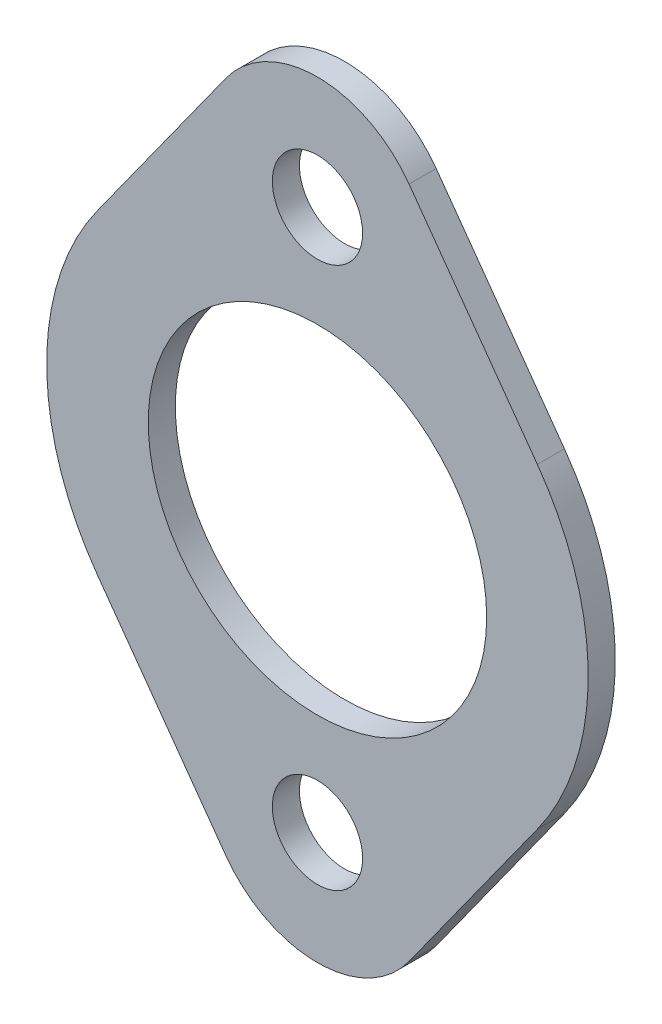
ISO-10303-21;
HEADER;
FILE_DESCRIPTION(('STEP AP214'),'2;1');
FILE_NAME('part.step','',(''),(''),'','','');
FILE_SCHEMA(('AUTOMOTIVE_DESIGN { 1 0 10303 214 1 1 1 1 }'));
ENDSEC;
DATA;
#1=APPLICATION_CONTEXT('core data for automotive mechanical design processes');
#2=APPLICATION_PROTOCOL_DEFINITION('international standard','automotive_design',2000,#1);
#3=PRODUCT_CONTEXT('',#1,'mechanical');
#4=PRODUCT('Part','Part','',(#3));
#5=PRODUCT_RELATED_PRODUCT_CATEGORY('part','',(#4));
#6=PRODUCT_DEFINITION_FORMATION('','',#4);
#7=PRODUCT_DEFINITION_CONTEXT('part definition',#1,'design');
#8=PRODUCT_DEFINITION('design','',#6,#7);
#9=PRODUCT_DEFINITION_SHAPE('','',#8);
#10=(LENGTH_UNIT() NAMED_UNIT(*) SI_UNIT(.MILLI.,.METRE.));
#11=(NAMED_UNIT(*) PLANE_ANGLE_UNIT() SI_UNIT($,.RADIAN.));
#12=(NAMED_UNIT(*) SI_UNIT($,.STERADIAN.) SOLID_ANGLE_UNIT());
#13=UNCERTAINTY_MEASURE_WITH_UNIT(LENGTH_MEASURE(1.E-05),#10,'distance_accuracy_value','');
#14=(GEOMETRIC_REPRESENTATION_CONTEXT(3) GLOBAL_UNCERTAINTY_ASSIGNED_CONTEXT((#13)) GLOBAL_UNIT_ASSIGNED_CONTEXT((#10,
#11,#12)) REPRESENTATION_CONTEXT('',''));
#15=CARTESIAN_POINT('',(0.,0.,0.));
#16=DIRECTION('',(0.,0.,1.));
#17=DIRECTION('',(1.,0.,0.));
#18=AXIS2_PLACEMENT_3D('',#15,#16,#17);
#19=CARTESIAN_POINT('',(0.,38.1,3.81));
#20=DIRECTION('',(0.,0.,-1.));
#21=DIRECTION('',(-1.,0.,0.));
#22=AXIS2_PLACEMENT_3D('',#19,#20,#21);
#23=CYLINDRICAL_SURFACE('',#22,15.875);
#24=CARTESIAN_POINT('',(0.,38.1,0.));
#25=DIRECTION('',(0.,0.,-1.));
#26=DIRECTION('',(-1.,0.,0.));
#27=AXIS2_PLACEMENT_3D('',#24,#25,#26);
#28=CIRCLE('',#27,15.875);
#29=CARTESIAN_POINT('',(-12.8941966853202,47.3604166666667,0.));
#30=VERTEX_POINT('',#29);
#31=CARTESIAN_POINT('',(12.8941966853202,47.3604166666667,0.));
#32=VERTEX_POINT('',#31);
#33=EDGE_CURVE('E95',#30,#32,#28,.T.);
#34=ORIENTED_EDGE('',*,*,#33,.F.);
#35=DIRECTION('',(0.,0.,-1.));
#36=VECTOR('',#35,1.);
#37=CARTESIAN_POINT('',(-12.8941966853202,47.3604166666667,3.81));
#38=LINE('',#37,#36);
#39=CARTESIAN_POINT('',(-12.8941966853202,47.3604166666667,3.81));
#40=VERTEX_POINT('',#39);
#41=EDGE_CURVE('E11',#40,#30,#38,.T.);
#42=ORIENTED_EDGE('',*,*,#41,.F.);
#43=CARTESIAN_POINT('',(0.,38.1,3.81));
#44=DIRECTION('',(0.,0.,-1.));
#45=DIRECTION('',(-1.,0.,0.));
#46=AXIS2_PLACEMENT_3D('',#43,#44,#45);
#47=CIRCLE('',#46,15.875);
#48=CARTESIAN_POINT('',(12.8941966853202,47.3604166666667,3.81));
#49=VERTEX_POINT('',#48);
#50=EDGE_CURVE('E96',#40,#49,#47,.T.);
#51=ORIENTED_EDGE('',*,*,#50,.T.);
#52=DIRECTION('',(0.,0.,-1.));
#53=VECTOR('',#52,1.);
#54=CARTESIAN_POINT('',(12.8941966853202,47.3604166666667,3.81));
#55=LINE('',#54,#53);
#56=EDGE_CURVE('E33',#49,#32,#55,.T.);
#57=ORIENTED_EDGE('',*,*,#56,.T.);
#58=EDGE_LOOP('',(#34,#42,#51,#57));
#59=FACE_BOUND('',#58,.T.);
#60=ADVANCED_FACE('F30',(#59),#23,.T.);
#61=CARTESIAN_POINT('',(-12.8941966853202,47.3604166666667,3.81));
#62=DIRECTION('',(0.812232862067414,-0.583333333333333,0.));
#63=DIRECTION('',(0.583333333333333,0.812232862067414,0.));
#64=AXIS2_PLACEMENT_3D('',#61,#62,#63);
#65=PLANE('',#64);
#66=DIRECTION('',(-0.583333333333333,-0.812232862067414,0.));
#67=VECTOR('',#66,1.);
#68=CARTESIAN_POINT('',(-12.8941966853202,47.3604166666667,0.));
#69=LINE('',#68,#67);
#70=CARTESIAN_POINT('',(-30.9460720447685,22.225,0.));
#71=VERTEX_POINT('',#70);
#72=EDGE_CURVE('E113',#30,#71,#69,.T.);
#73=ORIENTED_EDGE('',*,*,#72,.T.);
#74=DIRECTION('',(0.,0.,-1.));
#75=VECTOR('',#74,1.);
#76=CARTESIAN_POINT('',(-30.9460720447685,22.225,3.81));
#77=LINE('',#76,#75);
#78=CARTESIAN_POINT('',(-30.9460720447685,22.225,3.81));
#79=VERTEX_POINT('',#78);
#80=EDGE_CURVE('E38',#79,#71,#77,.T.);
#81=ORIENTED_EDGE('',*,*,#80,.F.);
#82=DIRECTION('',(-0.583333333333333,-0.812232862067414,0.));
#83=VECTOR('',#82,1.);
#84=CARTESIAN_POINT('',(-12.8941966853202,47.3604166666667,3.81));
#85=LINE('',#84,#83);
#86=EDGE_CURVE('E51',#40,#79,#85,.T.);
#87=ORIENTED_EDGE('',*,*,#86,.F.);
#88=ORIENTED_EDGE('',*,*,#41,.T.);
#89=EDGE_LOOP('',(#73,#81,#87,#88));
#90=FACE_BOUND('',#89,.T.);
#91=ADVANCED_FACE('F179',(#90),#65,.F.);
#92=CARTESIAN_POINT('',(0.,0.,3.81));
#93=DIRECTION('',(0.,0.,-1.));
#94=DIRECTION('',(-1.,0.,0.));
#95=AXIS2_PLACEMENT_3D('',#92,#93,#94);
#96=CYLINDRICAL_SURFACE('',#95,38.1);
#97=CARTESIAN_POINT('',(0.,0.,0.));
#98=DIRECTION('',(0.,0.,-1.));
#99=DIRECTION('',(-1.,0.,0.));
#100=AXIS2_PLACEMENT_3D('',#97,#98,#99);
#101=CIRCLE('',#100,38.1);
#102=CARTESIAN_POINT('',(-30.9460720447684,-22.225,0.));
#103=VERTEX_POINT('',#102);
#104=EDGE_CURVE('E130',#103,#71,#101,.T.);
#105=ORIENTED_EDGE('',*,*,#104,.F.);
#106=DIRECTION('',(0.,0.,-1.));
#107=VECTOR('',#106,1.);
#108=CARTESIAN_POINT('',(-30.9460720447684,-22.225,3.81));
#109=LINE('',#108,#107);
#110=CARTESIAN_POINT('',(-30.9460720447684,-22.225,3.81));
#111=VERTEX_POINT('',#110);
#112=EDGE_CURVE('E151',#111,#103,#109,.T.);
#113=ORIENTED_EDGE('',*,*,#112,.F.);
#114=CARTESIAN_POINT('',(0.,0.,3.81));
#115=DIRECTION('',(0.,0.,-1.));
#116=DIRECTION('',(-1.,0.,0.));
#117=AXIS2_PLACEMENT_3D('',#114,#115,#116);
#118=CIRCLE('',#117,38.1);
#119=EDGE_CURVE('E146',#111,#79,#118,.T.);
#120=ORIENTED_EDGE('',*,*,#119,.T.);
#121=ORIENTED_EDGE('',*,*,#80,.T.);
#122=EDGE_LOOP('',(#105,#113,#120,#121));
#123=FACE_BOUND('',#122,.T.);
#124=ADVANCED_FACE('F177',(#123),#96,.T.);
#125=CARTESIAN_POINT('',(-12.8941966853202,-47.3604166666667,3.81));
#126=DIRECTION('',(-0.812232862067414,-0.583333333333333,0.));
#127=DIRECTION('',(0.583333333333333,-0.812232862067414,0.));
#128=AXIS2_PLACEMENT_3D('',#125,#126,#127);
#129=PLANE('',#128);
#130=DIRECTION('',(-0.583333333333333,0.812232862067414,0.));
#131=VECTOR('',#130,1.);
#132=CARTESIAN_POINT('',(-12.8941966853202,-47.3604166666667,0.));
#133=LINE('',#132,#131);
#134=CARTESIAN_POINT('',(-12.8941966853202,-47.3604166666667,0.));
#135=VERTEX_POINT('',#134);
#136=EDGE_CURVE('E127',#135,#103,#133,.T.);
#137=ORIENTED_EDGE('',*,*,#136,.F.);
#138=DIRECTION('',(0.,0.,-1.));
#139=VECTOR('',#138,1.);
#140=CARTESIAN_POINT('',(-12.8941966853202,-47.3604166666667,3.81));
#141=LINE('',#140,#139);
#142=CARTESIAN_POINT('',(-12.8941966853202,-47.3604166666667,3.81));
#143=VERTEX_POINT('',#142);
#144=EDGE_CURVE('E153',#143,#135,#141,.T.);
#145=ORIENTED_EDGE('',*,*,#144,.F.);
#146=DIRECTION('',(-0.583333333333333,0.812232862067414,0.));
#147=VECTOR('',#146,1.);
#148=CARTESIAN_POINT('',(-12.8941966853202,-47.3604166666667,3.81));
#149=LINE('',#148,#147);
#150=EDGE_CURVE('E143',#143,#111,#149,.T.);
#151=ORIENTED_EDGE('',*,*,#150,.T.);
#152=ORIENTED_EDGE('',*,*,#112,.T.);
#153=EDGE_LOOP('',(#137,#145,#151,#152));
#154=FACE_BOUND('',#153,.T.);
#155=ADVANCED_FACE('F172',(#154),#129,.T.);
#156=CARTESIAN_POINT('',(0.,-38.1,3.81));
#157=DIRECTION('',(0.,0.,-1.));
#158=DIRECTION('',(-1.,0.,0.));
#159=AXIS2_PLACEMENT_3D('',#156,#157,#158);
#160=CYLINDRICAL_SURFACE('',#159,15.875);
#161=CARTESIAN_POINT('',(0.,-38.1,0.));
#162=DIRECTION('',(0.,0.,1.));
#163=DIRECTION('',(1.,0.,0.));
#164=AXIS2_PLACEMENT_3D('',#161,#162,#163);
#165=CIRCLE('',#164,15.875);
#166=CARTESIAN_POINT('',(12.8941966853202,-47.3604166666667,0.));
#167=VERTEX_POINT('',#166);
#168=EDGE_CURVE('E125',#135,#167,#165,.T.);
#169=ORIENTED_EDGE('',*,*,#168,.T.);
#170=DIRECTION('',(0.,0.,-1.));
#171=VECTOR('',#170,1.);
#172=CARTESIAN_POINT('',(12.8941966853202,-47.3604166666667,3.81));
#173=LINE('',#172,#171);
#174=CARTESIAN_POINT('',(12.8941966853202,-47.3604166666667,3.81));
#175=VERTEX_POINT('',#174);
#176=EDGE_CURVE('E155',#175,#167,#173,.T.);
#177=ORIENTED_EDGE('',*,*,#176,.F.);
#178=CARTESIAN_POINT('',(0.,-38.1,3.81));
#179=DIRECTION('',(0.,0.,1.));
#180=DIRECTION('',(1.,0.,0.));
#181=AXIS2_PLACEMENT_3D('',#178,#179,#180);
#182=CIRCLE('',#181,15.875);
#183=EDGE_CURVE('E141',#143,#175,#182,.T.);
#184=ORIENTED_EDGE('',*,*,#183,.F.);
#185=ORIENTED_EDGE('',*,*,#144,.T.);
#186=EDGE_LOOP('',(#169,#177,#184,#185));
#187=FACE_BOUND('',#186,.T.);
#188=ADVANCED_FACE('F181',(#187),#160,.T.);
#189=CARTESIAN_POINT('',(12.8941966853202,-47.3604166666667,3.81));
#190=DIRECTION('',(-0.812232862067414,0.583333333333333,0.));
#191=DIRECTION('',(-0.583333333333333,-0.812232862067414,0.));
#192=AXIS2_PLACEMENT_3D('',#189,#190,#191);
#193=PLANE('',#192);
#194=DIRECTION('',(0.583333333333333,0.812232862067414,0.));
#195=VECTOR('',#194,1.);
#196=CARTESIAN_POINT('',(12.8941966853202,-47.3604166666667,0.));
#197=LINE('',#196,#195);
#198=CARTESIAN_POINT('',(30.9460720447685,-22.225,0.));
#199=VERTEX_POINT('',#198);
#200=EDGE_CURVE('E122',#167,#199,#197,.T.);
#201=ORIENTED_EDGE('',*,*,#200,.T.);
#202=DIRECTION('',(0.,0.,-1.));
#203=VECTOR('',#202,1.);
#204=CARTESIAN_POINT('',(30.9460720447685,-22.225,3.81));
#205=LINE('',#204,#203);
#206=CARTESIAN_POINT('',(30.9460720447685,-22.225,3.81));
#207=VERTEX_POINT('',#206);
#208=EDGE_CURVE('E158',#207,#199,#205,.T.);
#209=ORIENTED_EDGE('',*,*,#208,.F.);
#210=DIRECTION('',(0.583333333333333,0.812232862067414,0.));
#211=VECTOR('',#210,1.);
#212=CARTESIAN_POINT('',(12.8941966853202,-47.3604166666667,3.81));
#213=LINE('',#212,#211);
#214=EDGE_CURVE('E139',#175,#207,#213,.T.);
#215=ORIENTED_EDGE('',*,*,#214,.F.);
#216=ORIENTED_EDGE('',*,*,#176,.T.);
#217=EDGE_LOOP('',(#201,#209,#215,#216));
#218=FACE_BOUND('',#217,.T.);
#219=ADVANCED_FACE('F166',(#218),#193,.F.);
#220=CARTESIAN_POINT('',(0.,0.,3.81));
#221=DIRECTION('',(0.,0.,-1.));
#222=DIRECTION('',(-1.,0.,0.));
#223=AXIS2_PLACEMENT_3D('',#220,#221,#222);
#224=CYLINDRICAL_SURFACE('',#223,38.1);
#225=CARTESIAN_POINT('',(0.,0.,0.));
#226=DIRECTION('',(0.,0.,-1.));
#227=DIRECTION('',(-1.,0.,0.));
#228=AXIS2_PLACEMENT_3D('',#225,#226,#227);
#229=CIRCLE('',#228,38.1);
#230=CARTESIAN_POINT('',(30.9460720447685,22.225,0.));
#231=VERTEX_POINT('',#230);
#232=EDGE_CURVE('E107',#231,#199,#229,.T.);
#233=ORIENTED_EDGE('',*,*,#232,.F.);
#234=DIRECTION('',(0.,0.,-1.));
#235=VECTOR('',#234,1.);
#236=CARTESIAN_POINT('',(30.9460720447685,22.225,3.81));
#237=LINE('',#236,#235);
#238=CARTESIAN_POINT('',(30.9460720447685,22.225,3.81));
#239=VERTEX_POINT('',#238);
#240=EDGE_CURVE('E100',#239,#231,#237,.T.);
#241=ORIENTED_EDGE('',*,*,#240,.F.);
#242=CARTESIAN_POINT('',(0.,0.,3.81));
#243=DIRECTION('',(0.,0.,-1.));
#244=DIRECTION('',(-1.,0.,0.));
#245=AXIS2_PLACEMENT_3D('',#242,#243,#244);
#246=CIRCLE('',#245,38.1);
#247=EDGE_CURVE('E136',#239,#207,#246,.T.);
#248=ORIENTED_EDGE('',*,*,#247,.T.);
#249=ORIENTED_EDGE('',*,*,#208,.T.);
#250=EDGE_LOOP('',(#233,#241,#248,#249));
#251=FACE_BOUND('',#250,.T.);
#252=ADVANCED_FACE('F161',(#251),#224,.T.);
#253=CARTESIAN_POINT('',(12.8941966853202,47.3604166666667,3.81));
#254=DIRECTION('',(0.812232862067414,0.583333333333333,0.));
#255=DIRECTION('',(-0.583333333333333,0.812232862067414,0.));
#256=AXIS2_PLACEMENT_3D('',#253,#254,#255);
#257=PLANE('',#256);
#258=DIRECTION('',(0.583333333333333,-0.812232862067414,0.));
#259=VECTOR('',#258,1.);
#260=CARTESIAN_POINT('',(12.8941966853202,47.3604166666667,0.));
#261=LINE('',#260,#259);
#262=EDGE_CURVE('E102',#32,#231,#261,.T.);
#263=ORIENTED_EDGE('',*,*,#262,.F.);
#264=ORIENTED_EDGE('',*,*,#56,.F.);
#265=DIRECTION('',(0.583333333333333,-0.812232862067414,0.));
#266=VECTOR('',#265,1.);
#267=CARTESIAN_POINT('',(12.8941966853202,47.3604166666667,3.81));
#268=LINE('',#267,#266);
#269=EDGE_CURVE('E134',#49,#239,#268,.T.);
#270=ORIENTED_EDGE('',*,*,#269,.T.);
#271=ORIENTED_EDGE('',*,*,#240,.T.);
#272=EDGE_LOOP('',(#263,#264,#270,#271));
#273=FACE_BOUND('',#272,.T.);
#274=ADVANCED_FACE('F103',(#273),#257,.T.);
#275=CARTESIAN_POINT('',(0.,38.1,3.81));
#276=DIRECTION('',(0.,0.,-1.));
#277=DIRECTION('',(-1.,0.,0.));
#278=AXIS2_PLACEMENT_3D('',#275,#276,#277);
#279=PLANE('',#278);
#280=CARTESIAN_POINT('',(0.,0.,3.81));
#281=DIRECTION('',(0.,0.,1.));
#282=DIRECTION('',(1.,0.,0.));
#283=AXIS2_PLACEMENT_3D('',#280,#281,#282);
#284=CIRCLE('',#283,23.8125);
#285=CARTESIAN_POINT('',(23.8125,0.,3.81));
#286=VERTEX_POINT('',#285);
#287=EDGE_CURVE('E225',#286,#286,#284,.T.);
#288=ORIENTED_EDGE('',*,*,#287,.F.);
#289=EDGE_LOOP('',(#288));
#290=FACE_BOUND('',#289,.T.);
#291=CARTESIAN_POINT('',(0.,-38.1,3.81));
#292=DIRECTION('',(0.,0.,1.));
#293=DIRECTION('',(1.,0.,0.));
#294=AXIS2_PLACEMENT_3D('',#291,#292,#293);
#295=CIRCLE('',#294,6.35);
#296=CARTESIAN_POINT('',(6.35,-38.1,3.81));
#297=VERTEX_POINT('',#296);
#298=EDGE_CURVE('E227',#297,#297,#295,.T.);
#299=ORIENTED_EDGE('',*,*,#298,.F.);
#300=EDGE_LOOP('',(#299));
#301=FACE_BOUND('',#300,.T.);
#302=CARTESIAN_POINT('',(0.,38.1,3.81));
#303=DIRECTION('',(0.,0.,1.));
#304=DIRECTION('',(1.,0.,0.));
#305=AXIS2_PLACEMENT_3D('',#302,#303,#304);
#306=CIRCLE('',#305,6.35);
#307=CARTESIAN_POINT('',(6.35,38.1,3.81));
#308=VERTEX_POINT('',#307);
#309=EDGE_CURVE('E117',#308,#308,#306,.T.);
#310=ORIENTED_EDGE('',*,*,#309,.F.);
#311=EDGE_LOOP('',(#310));
#312=FACE_BOUND('',#311,.T.);
#313=ORIENTED_EDGE('',*,*,#50,.F.);
#314=ORIENTED_EDGE('',*,*,#86,.T.);
#315=ORIENTED_EDGE('',*,*,#119,.F.);
#316=ORIENTED_EDGE('',*,*,#150,.F.);
#317=ORIENTED_EDGE('',*,*,#183,.T.);
#318=ORIENTED_EDGE('',*,*,#214,.T.);
#319=ORIENTED_EDGE('',*,*,#247,.F.);
#320=ORIENTED_EDGE('',*,*,#269,.F.);
#321=EDGE_LOOP('',(#313,#314,#315,#316,#317,#318,#319,#320));
#322=FACE_BOUND('',#321,.T.);
#323=ADVANCED_FACE('F180',(#290,#301,#312,#322),#279,.F.);
#324=CARTESIAN_POINT('',(0.,38.1,0.));
#325=DIRECTION('',(0.,0.,-1.));
#326=DIRECTION('',(-1.,0.,0.));
#327=AXIS2_PLACEMENT_3D('',#324,#325,#326);
#328=PLANE('',#327);
#329=CARTESIAN_POINT('',(0.,0.,0.));
#330=DIRECTION('',(0.,0.,1.));
#331=DIRECTION('',(1.,0.,0.));
#332=AXIS2_PLACEMENT_3D('',#329,#330,#331);
#333=CIRCLE('',#332,23.8125);
#334=CARTESIAN_POINT('',(23.8125,0.,0.));
#335=VERTEX_POINT('',#334);
#336=EDGE_CURVE('E222',#335,#335,#333,.T.);
#337=ORIENTED_EDGE('',*,*,#336,.T.);
#338=EDGE_LOOP('',(#337));
#339=FACE_BOUND('',#338,.T.);
#340=CARTESIAN_POINT('',(0.,-38.1,0.));
#341=DIRECTION('',(0.,0.,1.));
#342=DIRECTION('',(1.,0.,0.));
#343=AXIS2_PLACEMENT_3D('',#340,#341,#342);
#344=CIRCLE('',#343,6.35);
#345=CARTESIAN_POINT('',(6.35,-38.1,0.));
#346=VERTEX_POINT('',#345);
#347=EDGE_CURVE('E232',#346,#346,#344,.T.);
#348=ORIENTED_EDGE('',*,*,#347,.T.);
#349=EDGE_LOOP('',(#348));
#350=FACE_BOUND('',#349,.T.);
#351=CARTESIAN_POINT('',(0.,38.1,0.));
#352=DIRECTION('',(0.,0.,1.));
#353=DIRECTION('',(1.,0.,0.));
#354=AXIS2_PLACEMENT_3D('',#351,#352,#353);
#355=CIRCLE('',#354,6.35);
#356=CARTESIAN_POINT('',(6.35,38.1,0.));
#357=VERTEX_POINT('',#356);
#358=EDGE_CURVE('E114',#357,#357,#355,.T.);
#359=ORIENTED_EDGE('',*,*,#358,.T.);
#360=EDGE_LOOP('',(#359));
#361=FACE_BOUND('',#360,.T.);
#362=ORIENTED_EDGE('',*,*,#33,.T.);
#363=ORIENTED_EDGE('',*,*,#262,.T.);
#364=ORIENTED_EDGE('',*,*,#232,.T.);
#365=ORIENTED_EDGE('',*,*,#200,.F.);
#366=ORIENTED_EDGE('',*,*,#168,.F.);
#367=ORIENTED_EDGE('',*,*,#136,.T.);
#368=ORIENTED_EDGE('',*,*,#104,.T.);
#369=ORIENTED_EDGE('',*,*,#72,.F.);
#370=EDGE_LOOP('',(#362,#363,#364,#365,#366,#367,#368,#369));
#371=FACE_BOUND('',#370,.T.);
#372=ADVANCED_FACE('F110',(#339,#350,#361,#371),#328,.T.);
#373=CARTESIAN_POINT('',(0.,38.1,0.));
#374=DIRECTION('',(0.,0.,1.));
#375=DIRECTION('',(1.,0.,0.));
#376=AXIS2_PLACEMENT_3D('',#373,#374,#375);
#377=CYLINDRICAL_SURFACE('',#376,6.35);
#378=CARTESIAN_POINT('',(6.35,38.1,0.));
#379=CARTESIAN_POINT('',(6.35,38.1,0.0396874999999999));
#380=CARTESIAN_POINT('',(6.35,38.1,0.079375));
#381=CARTESIAN_POINT('',(6.35,38.1,0.15875));
#382=CARTESIAN_POINT('',(6.35,38.1,0.1984375));
#383=CARTESIAN_POINT('',(6.35,38.1,0.2778125));
#384=CARTESIAN_POINT('',(6.35,38.1,0.3175));
#385=CARTESIAN_POINT('',(6.35,38.1,0.396875));
#386=CARTESIAN_POINT('',(6.35,38.1,0.4365625));
#387=CARTESIAN_POINT('',(6.35,38.1,0.5159375));
#388=CARTESIAN_POINT('',(6.35,38.1,0.555625));
#389=CARTESIAN_POINT('',(6.35,38.1,0.635));
#390=CARTESIAN_POINT('',(6.35,38.1,0.6746875));
#391=CARTESIAN_POINT('',(6.35,38.1,0.7540625));
#392=CARTESIAN_POINT('',(6.35,38.1,0.79375));
#393=CARTESIAN_POINT('',(6.35,38.1,0.873125));
#394=CARTESIAN_POINT('',(6.35,38.1,0.9128125));
#395=CARTESIAN_POINT('',(6.35,38.1,0.9921875));
#396=CARTESIAN_POINT('',(6.35,38.1,1.031875));
#397=CARTESIAN_POINT('',(6.35,38.1,1.11125));
#398=CARTESIAN_POINT('',(6.35,38.1,1.1509375));
#399=CARTESIAN_POINT('',(6.35,38.1,1.2303125));
#400=CARTESIAN_POINT('',(6.35,38.1,1.27));
#401=CARTESIAN_POINT('',(6.35,38.1,1.349375));
#402=CARTESIAN_POINT('',(6.35,38.1,1.3890625));
#403=CARTESIAN_POINT('',(6.35,38.1,1.4684375));
#404=CARTESIAN_POINT('',(6.35,38.1,1.508125));
#405=CARTESIAN_POINT('',(6.35,38.1,1.5875));
#406=CARTESIAN_POINT('',(6.35,38.1,1.6271875));
#407=CARTESIAN_POINT('',(6.35,38.1,1.7065625));
#408=CARTESIAN_POINT('',(6.35,38.1,1.74625));
#409=CARTESIAN_POINT('',(6.35,38.1,1.825625));
#410=CARTESIAN_POINT('',(6.35,38.1,1.8653125));
#411=CARTESIAN_POINT('',(6.35,38.1,1.9446875));
#412=CARTESIAN_POINT('',(6.35,38.1,1.984375));
#413=CARTESIAN_POINT('',(6.35,38.1,2.06375));
#414=CARTESIAN_POINT('',(6.35,38.1,2.1034375));
#415=CARTESIAN_POINT('',(6.35,38.1,2.1828125));
#416=CARTESIAN_POINT('',(6.35,38.1,2.2225));
#417=CARTESIAN_POINT('',(6.35,38.1,2.301875));
#418=CARTESIAN_POINT('',(6.35,38.1,2.3415625));
#419=CARTESIAN_POINT('',(6.35,38.1,2.4209375));
#420=CARTESIAN_POINT('',(6.35,38.1,2.460625));
#421=CARTESIAN_POINT('',(6.35,38.1,2.54));
#422=CARTESIAN_POINT('',(6.35,38.1,2.5796875));
#423=CARTESIAN_POINT('',(6.35,38.1,2.6590625));
#424=CARTESIAN_POINT('',(6.35,38.1,2.69875));
#425=CARTESIAN_POINT('',(6.35,38.1,2.778125));
#426=CARTESIAN_POINT('',(6.35,38.1,2.8178125));
#427=CARTESIAN_POINT('',(6.35,38.1,2.8971875));
#428=CARTESIAN_POINT('',(6.35,38.1,2.936875));
#429=CARTESIAN_POINT('',(6.35,38.1,3.01625));
#430=CARTESIAN_POINT('',(6.35,38.1,3.0559375));
#431=CARTESIAN_POINT('',(6.35,38.1,3.1353125));
#432=CARTESIAN_POINT('',(6.35,38.1,3.175));
#433=CARTESIAN_POINT('',(6.35,38.1,3.254375));
#434=CARTESIAN_POINT('',(6.35,38.1,3.2940625));
#435=CARTESIAN_POINT('',(6.35,38.1,3.3734375));
#436=CARTESIAN_POINT('',(6.35,38.1,3.413125));
#437=CARTESIAN_POINT('',(6.35,38.1,3.4925));
#438=CARTESIAN_POINT('',(6.35,38.1,3.5321875));
#439=CARTESIAN_POINT('',(6.35,38.1,3.6115625));
#440=CARTESIAN_POINT('',(6.35,38.1,3.65125));
#441=CARTESIAN_POINT('',(6.35,38.1,3.730625));
#442=CARTESIAN_POINT('',(6.35,38.1,3.7703125));
#443=CARTESIAN_POINT('',(6.35,38.1,3.81));
#444=B_SPLINE_CURVE_WITH_KNOTS('',3,(#378,#379,#380,#381,#382,#383,#384,#385,#386,#387,#388,
#389,#390,#391,#392,#393,#394,#395,#396,#397,#398,#399,#400,#401,#402,#403,#404,#405,#406,#407,
#408,#409,#410,#411,#412,#413,#414,#415,#416,#417,#418,#419,#420,#421,#422,#423,#424,#425,#426,
#427,#428,#429,#430,#431,#432,#433,#434,#435,#436,#437,#438,#439,#440,#441,#442,#443),
.UNSPECIFIED.,.F.,.F.,(4,2,2,2,2,2,2,2,2,2,2,2,2,2,2,2,2,2,2,2,2,2,2,2,2,2,2,2,2,2,2,2,4),(0.,
0.1190625,0.238125,0.3571875,0.47625,0.5953125,0.714375,0.8334375,0.9525,1.0715625,1.190625,
1.3096875,1.42875,1.5478125,1.666875,1.7859375,1.905,2.0240625,2.143125,2.2621875,2.38125,
2.5003125,2.619375,2.7384375,2.8575,2.9765625,3.095625,3.2146875,3.33375,3.4528125,3.571875,
3.6909375,3.81),.UNSPECIFIED.);
#445=EDGE_CURVE('BSEAM205',#357,#308,#444,.T.);
#446=ORIENTED_EDGE('',*,*,#358,.F.);
#447=ORIENTED_EDGE('',*,*,#309,.T.);
#448=ORIENTED_EDGE('',*,*,#445,.T.);
#449=ORIENTED_EDGE('',*,*,#445,.F.);
#450=EDGE_LOOP('',(#446,#448,#447,#449));
#451=FACE_BOUND('',#450,.T.);
#452=ADVANCED_FACE('F205',(#451),#377,.F.);
#453=CARTESIAN_POINT('',(0.,-38.1,0.));
#454=DIRECTION('',(0.,0.,1.));
#455=DIRECTION('',(1.,0.,0.));
#456=AXIS2_PLACEMENT_3D('',#453,#454,#455);
#457=CYLINDRICAL_SURFACE('',#456,6.35);
#458=CARTESIAN_POINT('',(6.35,-38.1,0.));
#459=CARTESIAN_POINT('',(6.35,-38.1,0.0396874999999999));
#460=CARTESIAN_POINT('',(6.35,-38.1,0.079375));
#461=CARTESIAN_POINT('',(6.35,-38.1,0.15875));
#462=CARTESIAN_POINT('',(6.35,-38.1,0.1984375));
#463=CARTESIAN_POINT('',(6.35,-38.1,0.2778125));
#464=CARTESIAN_POINT('',(6.35,-38.1,0.3175));
#465=CARTESIAN_POINT('',(6.35,-38.1,0.396875));
#466=CARTESIAN_POINT('',(6.35,-38.1,0.4365625));
#467=CARTESIAN_POINT('',(6.35,-38.1,0.5159375));
#468=CARTESIAN_POINT('',(6.35,-38.1,0.555625));
#469=CARTESIAN_POINT('',(6.35,-38.1,0.635));
#470=CARTESIAN_POINT('',(6.35,-38.1,0.6746875));
#471=CARTESIAN_POINT('',(6.35,-38.1,0.7540625));
#472=CARTESIAN_POINT('',(6.35,-38.1,0.79375));
#473=CARTESIAN_POINT('',(6.35,-38.1,0.873125));
#474=CARTESIAN_POINT('',(6.35,-38.1,0.9128125));
#475=CARTESIAN_POINT('',(6.35,-38.1,0.9921875));
#476=CARTESIAN_POINT('',(6.35,-38.1,1.031875));
#477=CARTESIAN_POINT('',(6.35,-38.1,1.11125));
#478=CARTESIAN_POINT('',(6.35,-38.1,1.1509375));
#479=CARTESIAN_POINT('',(6.35,-38.1,1.2303125));
#480=CARTESIAN_POINT('',(6.35,-38.1,1.27));
#481=CARTESIAN_POINT('',(6.35,-38.1,1.349375));
#482=CARTESIAN_POINT('',(6.35,-38.1,1.3890625));
#483=CARTESIAN_POINT('',(6.35,-38.1,1.4684375));
#484=CARTESIAN_POINT('',(6.35,-38.1,1.508125));
#485=CARTESIAN_POINT('',(6.35,-38.1,1.5875));
#486=CARTESIAN_POINT('',(6.35,-38.1,1.6271875));
#487=CARTESIAN_POINT('',(6.35,-38.1,1.7065625));
#488=CARTESIAN_POINT('',(6.35,-38.1,1.74625));
#489=CARTESIAN_POINT('',(6.35,-38.1,1.825625));
#490=CARTESIAN_POINT('',(6.35,-38.1,1.8653125));
#491=CARTESIAN_POINT('',(6.35,-38.1,1.9446875));
#492=CARTESIAN_POINT('',(6.35,-38.1,1.984375));
#493=CARTESIAN_POINT('',(6.35,-38.1,2.06375));
#494=CARTESIAN_POINT('',(6.35,-38.1,2.1034375));
#495=CARTESIAN_POINT('',(6.35,-38.1,2.1828125));
#496=CARTESIAN_POINT('',(6.35,-38.1,2.2225));
#497=CARTESIAN_POINT('',(6.35,-38.1,2.301875));
#498=CARTESIAN_POINT('',(6.35,-38.1,2.3415625));
#499=CARTESIAN_POINT('',(6.35,-38.1,2.4209375));
#500=CARTESIAN_POINT('',(6.35,-38.1,2.460625));
#501=CARTESIAN_POINT('',(6.35,-38.1,2.54));
#502=CARTESIAN_POINT('',(6.35,-38.1,2.5796875));
#503=CARTESIAN_POINT('',(6.35,-38.1,2.6590625));
#504=CARTESIAN_POINT('',(6.35,-38.1,2.69875));
#505=CARTESIAN_POINT('',(6.35,-38.1,2.778125));
#506=CARTESIAN_POINT('',(6.35,-38.1,2.8178125));
#507=CARTESIAN_POINT('',(6.35,-38.1,2.8971875));
#508=CARTESIAN_POINT('',(6.35,-38.1,2.936875));
#509=CARTESIAN_POINT('',(6.35,-38.1,3.01625));
#510=CARTESIAN_POINT('',(6.35,-38.1,3.0559375));
#511=CARTESIAN_POINT('',(6.35,-38.1,3.1353125));
#512=CARTESIAN_POINT('',(6.35,-38.1,3.175));
#513=CARTESIAN_POINT('',(6.35,-38.1,3.254375));
#514=CARTESIAN_POINT('',(6.35,-38.1,3.2940625));
#515=CARTESIAN_POINT('',(6.35,-38.1,3.3734375));
#516=CARTESIAN_POINT('',(6.35,-38.1,3.413125));
#517=CARTESIAN_POINT('',(6.35,-38.1,3.4925));
#518=CARTESIAN_POINT('',(6.35,-38.1,3.5321875));
#519=CARTESIAN_POINT('',(6.35,-38.1,3.6115625));
#520=CARTESIAN_POINT('',(6.35,-38.1,3.65125));
#521=CARTESIAN_POINT('',(6.35,-38.1,3.730625));
#522=CARTESIAN_POINT('',(6.35,-38.1,3.7703125));
#523=CARTESIAN_POINT('',(6.35,-38.1,3.81));
#524=B_SPLINE_CURVE_WITH_KNOTS('',3,(#458,#459,#460,#461,#462,#463,#464,#465,#466,#467,#468,
#469,#470,#471,#472,#473,#474,#475,#476,#477,#478,#479,#480,#481,#482,#483,#484,#485,#486,#487,
#488,#489,#490,#491,#492,#493,#494,#495,#496,#497,#498,#499,#500,#501,#502,#503,#504,#505,#506,
#507,#508,#509,#510,#511,#512,#513,#514,#515,#516,#517,#518,#519,#520,#521,#522,#523),
.UNSPECIFIED.,.F.,.F.,(4,2,2,2,2,2,2,2,2,2,2,2,2,2,2,2,2,2,2,2,2,2,2,2,2,2,2,2,2,2,2,2,4),(0.,
0.1190625,0.238125,0.3571875,0.47625,0.5953125,0.714375,0.8334375,0.9525,1.0715625,1.190625,
1.3096875,1.42875,1.5478125,1.666875,1.7859375,1.905,2.0240625,2.143125,2.2621875,2.38125,
2.5003125,2.619375,2.7384375,2.8575,2.9765625,3.095625,3.2146875,3.33375,3.4528125,3.571875,
3.6909375,3.81),.UNSPECIFIED.);
#525=EDGE_CURVE('BSEAM209',#346,#297,#524,.T.);
#526=ORIENTED_EDGE('',*,*,#347,.F.);
#527=ORIENTED_EDGE('',*,*,#298,.T.);
#528=ORIENTED_EDGE('',*,*,#525,.T.);
#529=ORIENTED_EDGE('',*,*,#525,.F.);
#530=EDGE_LOOP('',(#526,#528,#527,#529));
#531=FACE_BOUND('',#530,.T.);
#532=ADVANCED_FACE('F209',(#531),#457,.F.);
#533=CARTESIAN_POINT('',(0.,0.,0.));
#534=DIRECTION('',(0.,0.,1.));
#535=DIRECTION('',(1.,0.,0.));
#536=AXIS2_PLACEMENT_3D('',#533,#534,#535);
#537=CYLINDRICAL_SURFACE('',#536,23.8125);
#538=CARTESIAN_POINT('',(23.8125,0.,0.));
#539=CARTESIAN_POINT('',(23.8125,0.,0.0396874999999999));
#540=CARTESIAN_POINT('',(23.8125,0.,0.079375));
#541=CARTESIAN_POINT('',(23.8125,0.,0.15875));
#542=CARTESIAN_POINT('',(23.8125,0.,0.1984375));
#543=CARTESIAN_POINT('',(23.8125,0.,0.2778125));
#544=CARTESIAN_POINT('',(23.8125,0.,0.3175));
#545=CARTESIAN_POINT('',(23.8125,0.,0.396875));
#546=CARTESIAN_POINT('',(23.8125,0.,0.4365625));
#547=CARTESIAN_POINT('',(23.8125,0.,0.5159375));
#548=CARTESIAN_POINT('',(23.8125,0.,0.555625));
#549=CARTESIAN_POINT('',(23.8125,0.,0.635));
#550=CARTESIAN_POINT('',(23.8125,0.,0.6746875));
#551=CARTESIAN_POINT('',(23.8125,0.,0.7540625));
#552=CARTESIAN_POINT('',(23.8125,0.,0.79375));
#553=CARTESIAN_POINT('',(23.8125,0.,0.873125));
#554=CARTESIAN_POINT('',(23.8125,0.,0.9128125));
#555=CARTESIAN_POINT('',(23.8125,0.,0.9921875));
#556=CARTESIAN_POINT('',(23.8125,0.,1.031875));
#557=CARTESIAN_POINT('',(23.8125,0.,1.11125));
#558=CARTESIAN_POINT('',(23.8125,0.,1.1509375));
#559=CARTESIAN_POINT('',(23.8125,0.,1.2303125));
#560=CARTESIAN_POINT('',(23.8125,0.,1.27));
#561=CARTESIAN_POINT('',(23.8125,0.,1.349375));
#562=CARTESIAN_POINT('',(23.8125,0.,1.3890625));
#563=CARTESIAN_POINT('',(23.8125,0.,1.4684375));
#564=CARTESIAN_POINT('',(23.8125,0.,1.508125));
#565=CARTESIAN_POINT('',(23.8125,0.,1.5875));
#566=CARTESIAN_POINT('',(23.8125,0.,1.6271875));
#567=CARTESIAN_POINT('',(23.8125,0.,1.7065625));
#568=CARTESIAN_POINT('',(23.8125,0.,1.74625));
#569=CARTESIAN_POINT('',(23.8125,0.,1.825625));
#570=CARTESIAN_POINT('',(23.8125,0.,1.8653125));
#571=CARTESIAN_POINT('',(23.8125,0.,1.9446875));
#572=CARTESIAN_POINT('',(23.8125,0.,1.984375));
#573=CARTESIAN_POINT('',(23.8125,0.,2.06375));
#574=CARTESIAN_POINT('',(23.8125,0.,2.1034375));
#575=CARTESIAN_POINT('',(23.8125,0.,2.1828125));
#576=CARTESIAN_POINT('',(23.8125,0.,2.2225));
#577=CARTESIAN_POINT('',(23.8125,0.,2.301875));
#578=CARTESIAN_POINT('',(23.8125,0.,2.3415625));
#579=CARTESIAN_POINT('',(23.8125,0.,2.4209375));
#580=CARTESIAN_POINT('',(23.8125,0.,2.460625));
#581=CARTESIAN_POINT('',(23.8125,0.,2.54));
#582=CARTESIAN_POINT('',(23.8125,0.,2.5796875));
#583=CARTESIAN_POINT('',(23.8125,0.,2.6590625));
#584=CARTESIAN_POINT('',(23.8125,0.,2.69875));
#585=CARTESIAN_POINT('',(23.8125,0.,2.778125));
#586=CARTESIAN_POINT('',(23.8125,0.,2.8178125));
#587=CARTESIAN_POINT('',(23.8125,0.,2.8971875));
#588=CARTESIAN_POINT('',(23.8125,0.,2.936875));
#589=CARTESIAN_POINT('',(23.8125,0.,3.01625));
#590=CARTESIAN_POINT('',(23.8125,0.,3.0559375));
#591=CARTESIAN_POINT('',(23.8125,0.,3.1353125));
#592=CARTESIAN_POINT('',(23.8125,0.,3.175));
#593=CARTESIAN_POINT('',(23.8125,0.,3.254375));
#594=CARTESIAN_POINT('',(23.8125,0.,3.2940625));
#595=CARTESIAN_POINT('',(23.8125,0.,3.3734375));
#596=CARTESIAN_POINT('',(23.8125,0.,3.413125));
#597=CARTESIAN_POINT('',(23.8125,0.,3.4925));
#598=CARTESIAN_POINT('',(23.8125,0.,3.5321875));
#599=CARTESIAN_POINT('',(23.8125,0.,3.6115625));
#600=CARTESIAN_POINT('',(23.8125,0.,3.65125));
#601=CARTESIAN_POINT('',(23.8125,0.,3.730625));
#602=CARTESIAN_POINT('',(23.8125,0.,3.7703125));
#603=CARTESIAN_POINT('',(23.8125,0.,3.81));
#604=B_SPLINE_CURVE_WITH_KNOTS('',3,(#538,#539,#540,#541,#542,#543,#544,#545,#546,#547,#548,
#549,#550,#551,#552,#553,#554,#555,#556,#557,#558,#559,#560,#561,#562,#563,#564,#565,#566,#567,
#568,#569,#570,#571,#572,#573,#574,#575,#576,#577,#578,#579,#580,#581,#582,#583,#584,#585,#586,
#587,#588,#589,#590,#591,#592,#593,#594,#595,#596,#597,#598,#599,#600,#601,#602,#603),
.UNSPECIFIED.,.F.,.F.,(4,2,2,2,2,2,2,2,2,2,2,2,2,2,2,2,2,2,2,2,2,2,2,2,2,2,2,2,2,2,2,2,4),(0.,
0.1190625,0.238125,0.3571875,0.47625,0.5953125,0.714375,0.8334375,0.9525,1.0715625,1.190625,
1.3096875,1.42875,1.5478125,1.666875,1.7859375,1.905,2.0240625,2.143125,2.2621875,2.38125,
2.5003125,2.619375,2.7384375,2.8575,2.9765625,3.095625,3.2146875,3.33375,3.4528125,3.571875,
3.6909375,3.81),.UNSPECIFIED.);
#605=EDGE_CURVE('BSEAM213',#335,#286,#604,.T.);
#606=ORIENTED_EDGE('',*,*,#336,.F.);
#607=ORIENTED_EDGE('',*,*,#287,.T.);
#608=ORIENTED_EDGE('',*,*,#605,.T.);
#609=ORIENTED_EDGE('',*,*,#605,.F.);
#610=EDGE_LOOP('',(#606,#608,#607,#609));
#611=FACE_BOUND('',#610,.T.);
#612=ADVANCED_FACE('F213',(#611),#537,.F.);
#613=CLOSED_SHELL('',(#60,#91,#124,#155,#188,#219,#252,#274,#323,#372,#452,#532,#612));
#614=MANIFOLD_SOLID_BREP('B2',#613);
#615=ADVANCED_BREP_SHAPE_REPRESENTATION('',(#18,#614),#14);
#616=SHAPE_DEFINITION_REPRESENTATION(#9,#615);
ENDSEC;
END-ISO-10303-21;
